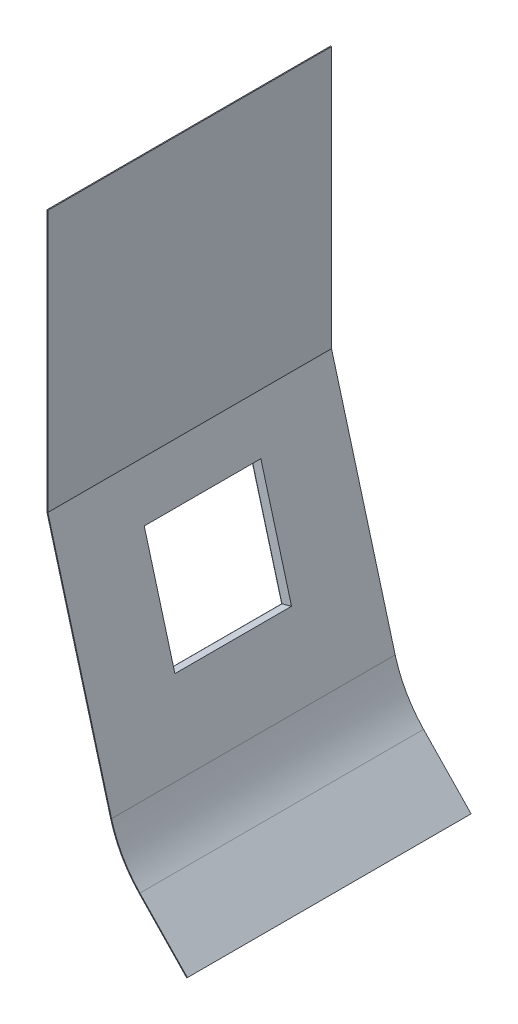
from build123d import *

# Parameters (mm, degrees)
BOSS_EXTRUDE2_DEPTH = 1192
SKETCH3_W           = 490
SKETCH3_H           = 490
CUT_EXTRUDE1_DEPTH  = 3138.720372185
SKETCH4_W           = 498
SKETCH4_H           = 498
SKETCH4_W_2         = 490
SKETCH4_H_2         = 490
BOSS_EXTRUDE4_DEPTH = 42
SKETCH19_W          = 560
SKETCH19_H          = 560
SKETCH19_W_2        = 490
SKETCH19_H_2        = 490
BOSS_EXTRUDE5_DEPTH = 4
FILLET1_R           = 5
FILLET2_R           = 1
FILLET3_R           = 35
SKETCH20_R          = 6
CUT_EXTRUDE2_DEPTH  = 4
SKETCH21_R          = 6
CUT_EXTRUDE3_DEPTH  = 4
LPATTERN1_COUNT     = 4
LPATTERN1_PITCH     = 120
LPATTERN2_COUNT     = 4
LPATTERN2_PITCH     = 120


with BuildPart() as part:
    # Sketch2 → Boss-Extrude2 (new body)
    with BuildSketch(Plane.XY):
        with BuildLine():
            Line((-1568.955446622, 167.663674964), (-1369.125446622, -40.078118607))
            Line((-1369.125446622, -40.078118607), (-1372.008236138, -42.851117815))
            Line((-1372.008236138, -42.851117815), (-1571.838236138, 164.890675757))
            ThreePointArc((-1571.838236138, 164.890675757), (-1645.1206192, 263.951948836), (-1691.950807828, 377.927283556))
            Line((-1691.950807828, 377.927283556), (-1959.577184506, 1358.98056887))
            Line((-1959.577184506, 1358.98056887), (-1959.577184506, 2458.98056887))
            Line((-1959.577184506, 2458.98056887), (-1955.577184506, 2458.98056887))
            Line((-1955.577184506, 2458.98056887), (-1955.577184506, 1359.516369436))
            Line((-1955.577184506, 1359.516369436), (-1688.091818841, 378.979996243))
            ThreePointArc((-1688.091818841, 378.979996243), (-1641.641732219, 265.926085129), (-1568.955446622, 167.663674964))
        make_face()
    extrude(amount=BOSS_EXTRUDE2_DEPTH)

    # Sketch3 → Cut-Extrude1 (cut, through all)
    with BuildSketch(Plane(origin=(-1478.805747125, -403.410731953, 0), x_dir=(0, 0, 1), z_dir=(-0.9647472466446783, -0.2631781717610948, 0))):
        with Locations((596, 1376.254902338)):
            Rectangle(SKETCH3_W, SKETCH3_H)
    extrude(amount=-CUT_EXTRUDE1_DEPTH, mode=Mode.SUBTRACT)

    # Sketch4 → Boss-Extrude4 (add)
    with BuildSketch(Plane(origin=(-1478.805747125, -403.410731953, 0), x_dir=(0, 0, 1), z_dir=(-0.9647472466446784, -0.263178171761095, 0))):
        with Locations((596, 1376.254902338)):
            Rectangle(SKETCH4_W, SKETCH4_H)
        with Locations((596, 1376.254902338)):
            Rectangle(SKETCH4_W_2, SKETCH4_H_2, mode=Mode.SUBTRACT)
    extrude(amount=BOSS_EXTRUDE4_DEPTH)

    # Sketch19 → Boss-Extrude5 (add)
    with BuildSketch(Plane(origin=(-1519.325131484, -414.464215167, 0), x_dir=(0, 0, 1), z_dir=(-0.9647472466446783, -0.2631781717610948, 0))):
        with Locations((596, 1376.254902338)):
            Rectangle(SKETCH19_W, SKETCH19_H)
        with Locations((596, 1376.254902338)):
            Rectangle(SKETCH19_W_2, SKETCH19_H_2, mode=Mode.SUBTRACT)
    extrude(amount=-BOSS_EXTRUDE5_DEPTH)

    # Fillet1
    fillet1_edges = [part.edges().sort_by_distance(p)[0] for p in [
        (-1881.525380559, 913.273912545, 841),
        (-1946.00403264, 1149.636987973, 596),
        (-1881.525380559, 913.273912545, 351),
        (-1817.046728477, 676.910837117, 596),
    ]]
    fillet(fillet1_edges, radius=FILLET1_R)

    # Fillet2
    fillet2_edges = [part.edges().sort_by_distance(p)[0] for p in [
        (-1877.666391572, 914.326625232, 347),
        (-1877.666391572, 914.326625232, 845),
        (-1812.135026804, 674.104560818, 596),
        (-1943.197756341, 1154.548689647, 596),
    ]]
    fillet(fillet2_edges, radius=FILLET2_R)

    # Fillet3
    fillet3_edges = [part.edges().sort_by_distance(p)[0] for p in [
        (-1805.905997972, 643.671039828, 316),
        (-1953.285774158, 1183.929497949, 316),
        (-1953.285774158, 1183.929497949, 876),
        (-1805.905997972, 643.671039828, 876),
    ]]
    fillet(fillet3_edges, radius=FILLET3_R)

    # Sketch20 → Cut-Extrude2 (cut)
    with BuildSketch(Plane(origin=(-1519.325131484, -414.464215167, 0), x_dir=(0, 0, 1), z_dir=(-0.9647472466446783, -0.2631781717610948, 0))):
        with Locations(Location((776, 1111.254902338, 0), (0, 0, 270))):
            Circle(SKETCH20_R)
        with Locations(Location((776, 1641.254902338, 0), (0, 0, 270))):
            Circle(SKETCH20_R)
    cut_extrude2 = extrude(amount=-CUT_EXTRUDE2_DEPTH, mode=Mode.SUBTRACT)

    # Sketch21 → Cut-Extrude3 (cut)
    with BuildSketch(Plane(origin=(-1519.325131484, -414.464215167, 0), x_dir=(0, 0, 1), z_dir=(-0.9647472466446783, -0.2631781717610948, 0))):
        with Locations(Location((861, 1196.254902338, 0), (0, 0, 270))):
            Circle(SKETCH21_R)
        with Locations(Location((331, 1196.254902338, 0), (0, 0, 270))):
            Circle(SKETCH21_R)
    cut_extrude3 = extrude(amount=-CUT_EXTRUDE3_DEPTH, mode=Mode.SUBTRACT)

    # LPattern1: Cut-Extrude2 ×4
    with Locations(*[(0, 0, -i * LPATTERN1_PITCH) for i in range(1, LPATTERN1_COUNT)]):
        add(cut_extrude2, mode=Mode.SUBTRACT)

    # LPattern2: Cut-Extrude3 ×4
    with Locations(*[Vector(-0.2631781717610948, 0.9647472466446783, 0) * (i * LPATTERN2_PITCH) for i in range(1, LPATTERN2_COUNT)]):
        add(cut_extrude3, mode=Mode.SUBTRACT)


solid = part.part
